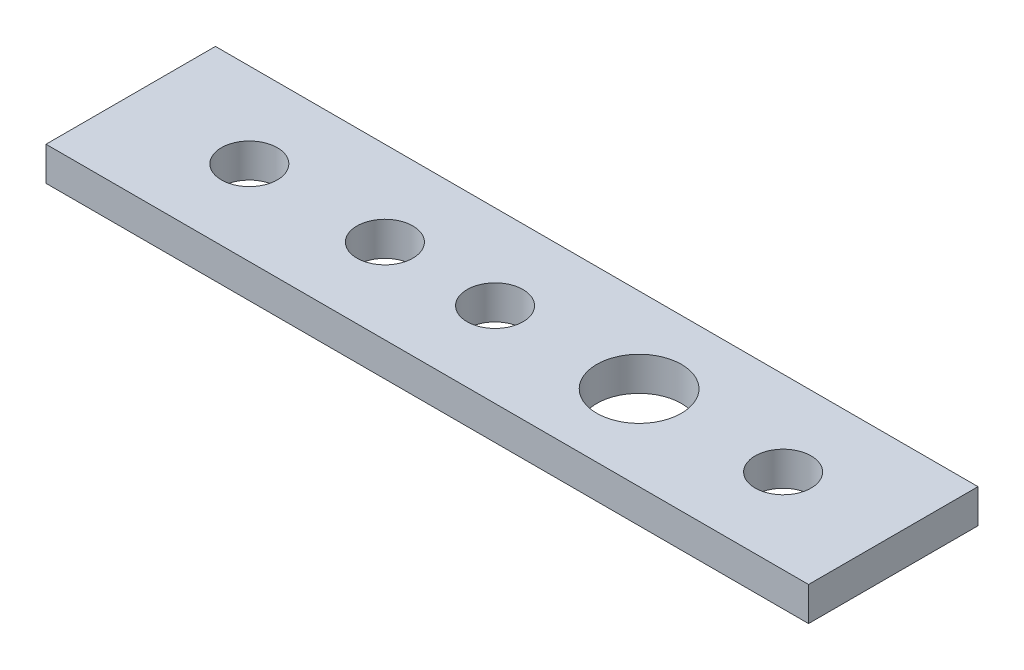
from build123d import *

# Parameters (mm, degrees)
SKETCH_1_W              = 45
SKETCH_1_H              = 10
EXTRUDE_1_DEPTH         = 2
HOLE_WIZARD_3_3_3_3_1_D = 3.3
HOLE_WIZARD_5_0_5_1_D   = 5


with BuildPart() as part:
    # Sketch 1 → Extrude 1 (new body)
    with BuildSketch(Plane(origin=(0, 0, 0), x_dir=(1, 0, 0), z_dir=(0, 1, 0))):
        with Locations((22.5, 5)):
            Rectangle(SKETCH_1_W, SKETCH_1_H)
    extrude(amount=EXTRUDE_1_DEPTH)

    # Hole Wizard 3.3 _3.3_ _1 (through all)
    with Locations(Plane(origin=(0, 2, 0), x_dir=(1, 0, 0), z_dir=(0, 1, 0))):
        with Locations((21.5, 5), (38.5, 5), (15, 5), (7, 5)):
            Hole(HOLE_WIZARD_3_3_3_3_1_D / 2)

    # Hole Wizard 5.0 _5_ _1 (through all)
    with Locations(Plane(origin=(0, 0, 0), x_dir=(-1, 0, 0), z_dir=(0, -1, 0))):
        with Locations((-30, 5)):
            Hole(HOLE_WIZARD_5_0_5_1_D / 2)


solid = part.part
